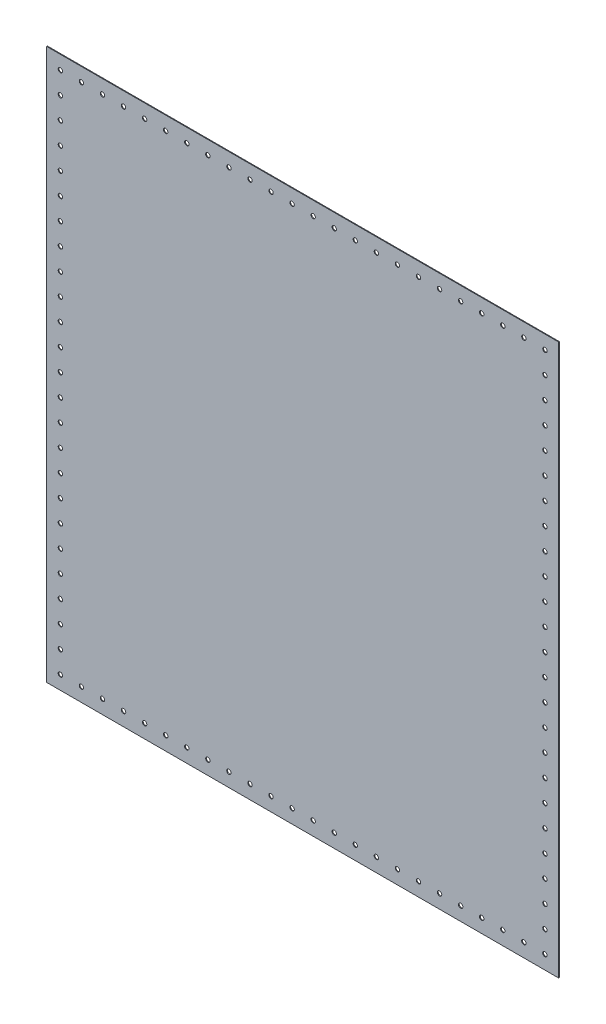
from build123d import *

# Parameters (mm, degrees)
SK_47_986IN_PNL_W = 1218.8444
SK_47_986IN_PNL_H = 1132.8
PANEL_DEPTH       = 1.5875
SKETCH1_R         = 4.826
HOLES_DEPTH       = 10


with BuildPart() as part:
    # sk 47.986in pnl → Panel (new body)
    with BuildSketch(Plane(origin=(0, 0, 0), x_dir=(0, 1, 0), z_dir=(0, 0, 1))):
        Rectangle(SK_47_986IN_PNL_W, SK_47_986IN_PNL_H)
    extrude(amount=PANEL_DEPTH)

    # Sketch1 → Holes (cut)
    with BuildSketch(Plane(origin=(0, 0, 0), x_dir=(0, 1, 0), z_dir=(0, 0, 1))):
        with Locations(Location((-579.12, -536.0978, 0), (0, 0, 270))):
            Circle(SKETCH1_R)
        with Locations(Location((579.12, 536.0978, 0), (0, 0, 270))):
            Circle(SKETCH1_R)
        with Locations(Location((-530.86, -536.0978, 0), (0, 0, 270))):
            Circle(SKETCH1_R)
        with Locations(Location((-482.6, -536.0978, 0), (0, 0, 270))):
            Circle(SKETCH1_R)
        with Locations(Location((-434.34, -536.0978, 0), (0, 0, 270))):
            Circle(SKETCH1_R)
        with Locations(Location((-386.08, -536.0978, 0), (0, 0, 270))):
            Circle(SKETCH1_R)
        with Locations(Location((-337.82, -536.0978, 0), (0, 0, 270))):
            Circle(SKETCH1_R)
        with Locations(Location((-289.56, -536.0978, 0), (0, 0, 270))):
            Circle(SKETCH1_R)
        with Locations(Location((-241.3, -536.0978, 0), (0, 0, 270))):
            Circle(SKETCH1_R)
        with Locations(Location((-193.04, -536.0978, 0), (0, 0, 270))):
            Circle(SKETCH1_R)
        with Locations(Location((-144.78, -536.0978, 0), (0, 0, 270))):
            Circle(SKETCH1_R)
        with Locations(Location((-96.52, -536.0978, 0), (0, 0, 270))):
            Circle(SKETCH1_R)
        with Locations(Location((-48.26, -536.0978, 0), (0, 0, 270))):
            Circle(SKETCH1_R)
        with Locations(Location((0, -536.0978, 0), (0, 0, 270))):
            Circle(SKETCH1_R)
        with Locations(Location((48.26, -536.0978, 0), (0, 0, 270))):
            Circle(SKETCH1_R)
        with Locations(Location((96.52, -536.0978, 0), (0, 0, 270))):
            Circle(SKETCH1_R)
        with Locations(Location((144.78, -536.0978, 0), (0, 0, 270))):
            Circle(SKETCH1_R)
        with Locations(Location((193.04, -536.0978, 0), (0, 0, 270))):
            Circle(SKETCH1_R)
        with Locations(Location((241.3, -536.0978, 0), (0, 0, 270))):
            Circle(SKETCH1_R)
        with Locations(Location((289.56, -536.0978, 0), (0, 0, 270))):
            Circle(SKETCH1_R)
        with Locations(Location((337.82, -536.0978, 0), (0, 0, 270))):
            Circle(SKETCH1_R)
        with Locations(Location((386.08, -536.0978, 0), (0, 0, 270))):
            Circle(SKETCH1_R)
        with Locations(Location((434.34, -536.0978, 0), (0, 0, 270))):
            Circle(SKETCH1_R)
        with Locations(Location((482.6, -536.0978, 0), (0, 0, 270))):
            Circle(SKETCH1_R)
        with Locations(Location((530.86, -536.0978, 0), (0, 0, 270))):
            Circle(SKETCH1_R)
        with Locations(Location((579.12, -536.0978, 0), (0, 0, 270))):
            Circle(SKETCH1_R)
        with Locations(Location((530.86, 536.0978, 0), (0, 0, 270))):
            Circle(SKETCH1_R)
        with Locations(Location((482.6, 536.0978, 0), (0, 0, 270))):
            Circle(SKETCH1_R)
        with Locations(Location((434.34, 536.0978, 0), (0, 0, 270))):
            Circle(SKETCH1_R)
        with Locations(Location((386.08, 536.0978, 0), (0, 0, 270))):
            Circle(SKETCH1_R)
        with Locations(Location((337.82, 536.0978, 0), (0, 0, 270))):
            Circle(SKETCH1_R)
        with Locations(Location((289.56, 536.0978, 0), (0, 0, 270))):
            Circle(SKETCH1_R)
        with Locations(Location((241.3, 536.0978, 0), (0, 0, 270))):
            Circle(SKETCH1_R)
        with Locations(Location((193.04, 536.0978, 0), (0, 0, 270))):
            Circle(SKETCH1_R)
        with Locations(Location((144.78, 536.0978, 0), (0, 0, 270))):
            Circle(SKETCH1_R)
        with Locations(Location((96.52, 536.0978, 0), (0, 0, 270))):
            Circle(SKETCH1_R)
        with Locations(Location((48.26, 536.0978, 0), (0, 0, 270))):
            Circle(SKETCH1_R)
        with Locations(Location((0, 536.0978, 0), (0, 0, 270))):
            Circle(SKETCH1_R)
        with Locations(Location((-48.26, 536.0978, 0), (0, 0, 270))):
            Circle(SKETCH1_R)
        with Locations(Location((-96.52, 536.0978, 0), (0, 0, 270))):
            Circle(SKETCH1_R)
        with Locations(Location((-144.78, 536.0978, 0), (0, 0, 270))):
            Circle(SKETCH1_R)
        with Locations(Location((-193.04, 536.0978, 0), (0, 0, 270))):
            Circle(SKETCH1_R)
        with Locations(Location((-241.3, 536.0978, 0), (0, 0, 270))):
            Circle(SKETCH1_R)
        with Locations(Location((-289.56, 536.0978, 0), (0, 0, 270))):
            Circle(SKETCH1_R)
        with Locations(Location((-337.82, 536.0978, 0), (0, 0, 270))):
            Circle(SKETCH1_R)
        with Locations(Location((-386.08, 536.0978, 0), (0, 0, 270))):
            Circle(SKETCH1_R)
        with Locations(Location((-434.34, 536.0978, 0), (0, 0, 270))):
            Circle(SKETCH1_R)
        with Locations(Location((-482.6, 536.0978, 0), (0, 0, 270))):
            Circle(SKETCH1_R)
        with Locations(Location((-530.86, 536.0978, 0), (0, 0, 270))):
            Circle(SKETCH1_R)
        with Locations(Location((-579.12, 536.0978, 0), (0, 0, 270))):
            Circle(SKETCH1_R)
        with Locations(Location((-579.12, -489.4806, 0), (0, 0, 270))):
            Circle(SKETCH1_R)
        with Locations(Location((-579.12, -442.8634, 0), (0, 0, 270))):
            Circle(SKETCH1_R)
        with Locations(Location((-579.12, -396.2462, 0), (0, 0, 270))):
            Circle(SKETCH1_R)
        with Locations(Location((-579.12, -349.629, 0), (0, 0, 270))):
            Circle(SKETCH1_R)
        with Locations(Location((-579.12, -303.0118, 0), (0, 0, 270))):
            Circle(SKETCH1_R)
        with Locations(Location((-579.12, -256.3946, 0), (0, 0, 270))):
            Circle(SKETCH1_R)
        with Locations(Location((-579.12, -209.7774, 0), (0, 0, 270))):
            Circle(SKETCH1_R)
        with Locations(Location((-579.12, -163.1602, 0), (0, 0, 270))):
            Circle(SKETCH1_R)
        with Locations(Location((-579.12, -116.543, 0), (0, 0, 270))):
            Circle(SKETCH1_R)
        with Locations(Location((-579.12, -69.9258, 0), (0, 0, 270))):
            Circle(SKETCH1_R)
        with Locations(Location((-579.12, -23.3086, 0), (0, 0, 270))):
            Circle(SKETCH1_R)
        with Locations(Location((-579.12, 23.3086, 0), (0, 0, 270))):
            Circle(SKETCH1_R)
        with Locations(Location((-579.12, 69.9258, 0), (0, 0, 270))):
            Circle(SKETCH1_R)
        with Locations(Location((-579.12, 116.543, 0), (0, 0, 270))):
            Circle(SKETCH1_R)
        with Locations(Location((-579.12, 163.1602, 0), (0, 0, 270))):
            Circle(SKETCH1_R)
        with Locations(Location((-579.12, 209.7774, 0), (0, 0, 270))):
            Circle(SKETCH1_R)
        with Locations(Location((-579.12, 256.3946, 0), (0, 0, 270))):
            Circle(SKETCH1_R)
        with Locations(Location((-579.12, 303.0118, 0), (0, 0, 270))):
            Circle(SKETCH1_R)
        with Locations(Location((-579.12, 349.629, 0), (0, 0, 270))):
            Circle(SKETCH1_R)
        with Locations(Location((-579.12, 396.2462, 0), (0, 0, 270))):
            Circle(SKETCH1_R)
        with Locations(Location((-579.12, 442.8634, 0), (0, 0, 270))):
            Circle(SKETCH1_R)
        with Locations(Location((-579.12, 489.4806, 0), (0, 0, 270))):
            Circle(SKETCH1_R)
        with Locations(Location((579.12, 489.4806, 0), (0, 0, 270))):
            Circle(SKETCH1_R)
        with Locations(Location((579.12, 442.8634, 0), (0, 0, 270))):
            Circle(SKETCH1_R)
        with Locations(Location((579.12, 396.2462, 0), (0, 0, 270))):
            Circle(SKETCH1_R)
        with Locations(Location((579.12, 349.629, 0), (0, 0, 270))):
            Circle(SKETCH1_R)
        with Locations(Location((579.12, 303.0118, 0), (0, 0, 270))):
            Circle(SKETCH1_R)
        with Locations(Location((579.12, 256.3946, 0), (0, 0, 270))):
            Circle(SKETCH1_R)
        with Locations(Location((579.12, 209.7774, 0), (0, 0, 270))):
            Circle(SKETCH1_R)
        with Locations(Location((579.12, 163.1602, 0), (0, 0, 270))):
            Circle(SKETCH1_R)
        with Locations(Location((579.12, 116.543, 0), (0, 0, 270))):
            Circle(SKETCH1_R)
        with Locations(Location((579.12, 69.9258, 0), (0, 0, 270))):
            Circle(SKETCH1_R)
        with Locations(Location((579.12, 23.3086, 0), (0, 0, 270))):
            Circle(SKETCH1_R)
        with Locations(Location((579.12, -23.3086, 0), (0, 0, 270))):
            Circle(SKETCH1_R)
        with Locations(Location((579.12, -69.9258, 0), (0, 0, 270))):
            Circle(SKETCH1_R)
        with Locations(Location((579.12, -116.543, 0), (0, 0, 270))):
            Circle(SKETCH1_R)
        with Locations(Location((579.12, -163.1602, 0), (0, 0, 270))):
            Circle(SKETCH1_R)
        with Locations(Location((579.12, -209.7774, 0), (0, 0, 270))):
            Circle(SKETCH1_R)
        with Locations(Location((579.12, -256.3946, 0), (0, 0, 270))):
            Circle(SKETCH1_R)
        with Locations(Location((579.12, -303.0118, 0), (0, 0, 270))):
            Circle(SKETCH1_R)
        with Locations(Location((579.12, -349.629, 0), (0, 0, 270))):
            Circle(SKETCH1_R)
        with Locations(Location((579.12, -396.2462, 0), (0, 0, 270))):
            Circle(SKETCH1_R)
        with Locations(Location((579.12, -442.8634, 0), (0, 0, 270))):
            Circle(SKETCH1_R)
        with Locations(Location((579.12, -489.4806, 0), (0, 0, 270))):
            Circle(SKETCH1_R)
    extrude(amount=HOLES_DEPTH, mode=Mode.SUBTRACT)


solid = part.part
